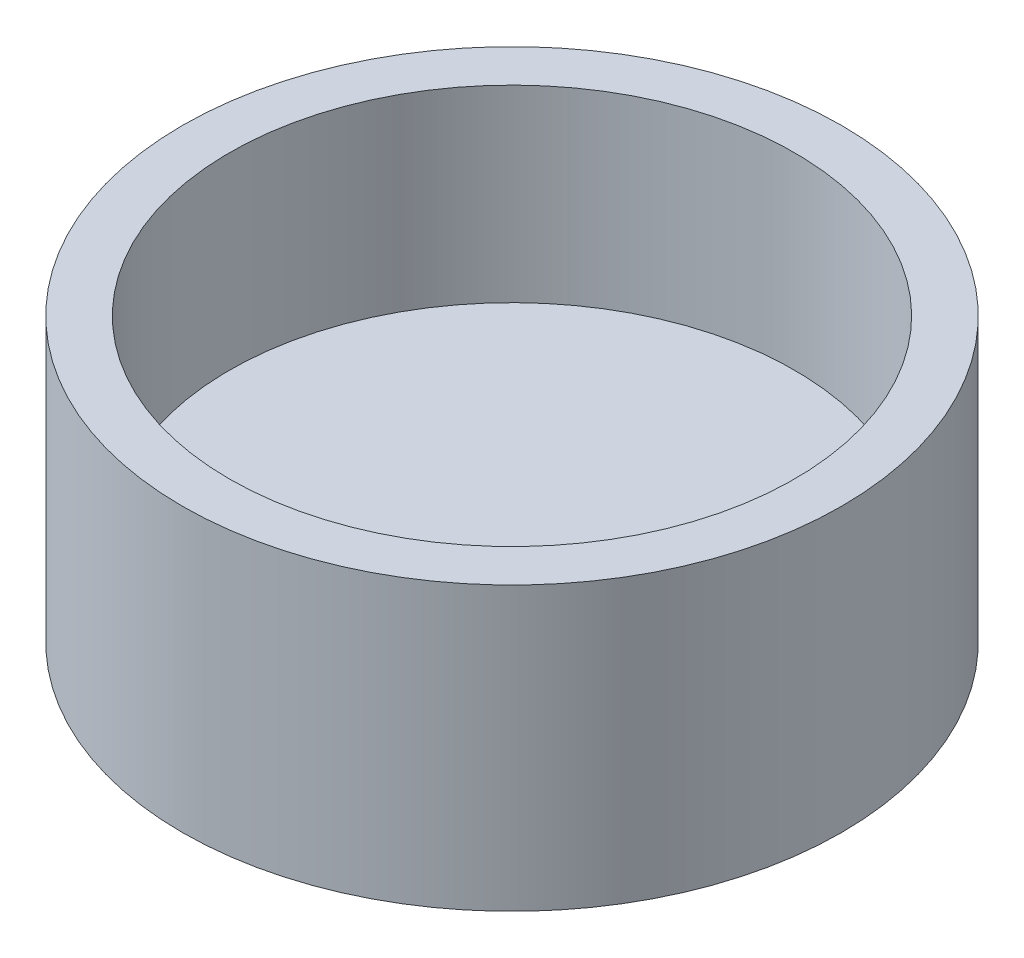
ISO-10303-21;
HEADER;
FILE_DESCRIPTION(('STEP AP214'),'2;1');
FILE_NAME('part.step','',(''),(''),'','','');
FILE_SCHEMA(('AUTOMOTIVE_DESIGN { 1 0 10303 214 1 1 1 1 }'));
ENDSEC;
DATA;
#1=APPLICATION_CONTEXT('core data for automotive mechanical design processes');
#2=APPLICATION_PROTOCOL_DEFINITION('international standard','automotive_design',2000,#1);
#3=PRODUCT_CONTEXT('',#1,'mechanical');
#4=PRODUCT('Part','Part','',(#3));
#5=PRODUCT_RELATED_PRODUCT_CATEGORY('part','',(#4));
#6=PRODUCT_DEFINITION_FORMATION('','',#4);
#7=PRODUCT_DEFINITION_CONTEXT('part definition',#1,'design');
#8=PRODUCT_DEFINITION('design','',#6,#7);
#9=PRODUCT_DEFINITION_SHAPE('','',#8);
#10=(LENGTH_UNIT() NAMED_UNIT(*) SI_UNIT(.MILLI.,.METRE.));
#11=(NAMED_UNIT(*) PLANE_ANGLE_UNIT() SI_UNIT($,.RADIAN.));
#12=(NAMED_UNIT(*) SI_UNIT($,.STERADIAN.) SOLID_ANGLE_UNIT());
#13=UNCERTAINTY_MEASURE_WITH_UNIT(LENGTH_MEASURE(1.E-05),#10,'distance_accuracy_value','');
#14=(GEOMETRIC_REPRESENTATION_CONTEXT(3) GLOBAL_UNCERTAINTY_ASSIGNED_CONTEXT((#13)) GLOBAL_UNIT_ASSIGNED_CONTEXT((#10,
#11,#12)) REPRESENTATION_CONTEXT('',''));
#15=CARTESIAN_POINT('',(0.,0.,0.));
#16=DIRECTION('',(0.,0.,1.));
#17=DIRECTION('',(1.,0.,0.));
#18=AXIS2_PLACEMENT_3D('',#15,#16,#17);
#19=CARTESIAN_POINT('',(0.,38.1,0.));
#20=DIRECTION('',(0.,-1.,0.));
#21=DIRECTION('',(0.,0.,-1.));
#22=AXIS2_PLACEMENT_3D('',#19,#20,#21);
#23=CYLINDRICAL_SURFACE('',#22,44.45);
#24=CARTESIAN_POINT('',(0.,38.1,0.));
#25=DIRECTION('',(0.,1.,0.));
#26=DIRECTION('',(0.,0.,1.));
#27=AXIS2_PLACEMENT_3D('',#24,#25,#26);
#28=CIRCLE('',#27,44.45);
#29=CARTESIAN_POINT('',(0.,38.1,-44.45));
#30=VERTEX_POINT('',#29);
#31=EDGE_CURVE('E10',#30,#30,#28,.T.);
#32=CARTESIAN_POINT('',(0.,0.,0.));
#33=DIRECTION('',(0.,1.,0.));
#34=DIRECTION('',(0.,0.,1.));
#35=AXIS2_PLACEMENT_3D('',#32,#33,#34);
#36=CIRCLE('',#35,44.45);
#37=CARTESIAN_POINT('',(0.,0.,-44.45));
#38=VERTEX_POINT('',#37);
#39=EDGE_CURVE('E42',#38,#38,#36,.T.);
#40=CARTESIAN_POINT('',(0.,38.1,-44.45));
#41=CARTESIAN_POINT('',(0.,37.703125,-44.45));
#42=CARTESIAN_POINT('',(0.,37.30625,-44.45));
#43=CARTESIAN_POINT('',(0.,36.5125,-44.45));
#44=CARTESIAN_POINT('',(0.,36.115625,-44.45));
#45=CARTESIAN_POINT('',(0.,35.321875,-44.45));
#46=CARTESIAN_POINT('',(0.,34.925,-44.45));
#47=CARTESIAN_POINT('',(0.,34.13125,-44.45));
#48=CARTESIAN_POINT('',(0.,33.734375,-44.45));
#49=CARTESIAN_POINT('',(0.,32.940625,-44.45));
#50=CARTESIAN_POINT('',(0.,32.54375,-44.45));
#51=CARTESIAN_POINT('',(0.,31.75,-44.45));
#52=CARTESIAN_POINT('',(0.,31.353125,-44.45));
#53=CARTESIAN_POINT('',(0.,30.559375,-44.45));
#54=CARTESIAN_POINT('',(0.,30.1625,-44.45));
#55=CARTESIAN_POINT('',(0.,29.36875,-44.45));
#56=CARTESIAN_POINT('',(0.,28.971875,-44.45));
#57=CARTESIAN_POINT('',(0.,28.178125,-44.45));
#58=CARTESIAN_POINT('',(0.,27.78125,-44.45));
#59=CARTESIAN_POINT('',(0.,26.9875,-44.45));
#60=CARTESIAN_POINT('',(0.,26.590625,-44.45));
#61=CARTESIAN_POINT('',(0.,25.796875,-44.45));
#62=CARTESIAN_POINT('',(0.,25.4,-44.45));
#63=CARTESIAN_POINT('',(0.,24.60625,-44.45));
#64=CARTESIAN_POINT('',(0.,24.209375,-44.45));
#65=CARTESIAN_POINT('',(0.,23.415625,-44.45));
#66=CARTESIAN_POINT('',(0.,23.01875,-44.45));
#67=CARTESIAN_POINT('',(0.,22.225,-44.45));
#68=CARTESIAN_POINT('',(0.,21.828125,-44.45));
#69=CARTESIAN_POINT('',(0.,21.034375,-44.45));
#70=CARTESIAN_POINT('',(0.,20.6375,-44.45));
#71=CARTESIAN_POINT('',(0.,19.84375,-44.45));
#72=CARTESIAN_POINT('',(0.,19.446875,-44.45));
#73=CARTESIAN_POINT('',(0.,18.653125,-44.45));
#74=CARTESIAN_POINT('',(0.,18.25625,-44.45));
#75=CARTESIAN_POINT('',(0.,17.4625,-44.45));
#76=CARTESIAN_POINT('',(0.,17.065625,-44.45));
#77=CARTESIAN_POINT('',(0.,16.271875,-44.45));
#78=CARTESIAN_POINT('',(0.,15.875,-44.45));
#79=CARTESIAN_POINT('',(0.,15.08125,-44.45));
#80=CARTESIAN_POINT('',(0.,14.684375,-44.45));
#81=CARTESIAN_POINT('',(0.,13.890625,-44.45));
#82=CARTESIAN_POINT('',(0.,13.49375,-44.45));
#83=CARTESIAN_POINT('',(0.,12.7,-44.45));
#84=CARTESIAN_POINT('',(0.,12.303125,-44.45));
#85=CARTESIAN_POINT('',(0.,11.509375,-44.45));
#86=CARTESIAN_POINT('',(0.,11.1125,-44.45));
#87=CARTESIAN_POINT('',(0.,10.31875,-44.45));
#88=CARTESIAN_POINT('',(0.,9.921875,-44.45));
#89=CARTESIAN_POINT('',(0.,9.128125,-44.45));
#90=CARTESIAN_POINT('',(0.,8.73125,-44.45));
#91=CARTESIAN_POINT('',(0.,7.9375,-44.45));
#92=CARTESIAN_POINT('',(0.,7.540625,-44.45));
#93=CARTESIAN_POINT('',(0.,6.746875,-44.45));
#94=CARTESIAN_POINT('',(0.,6.35,-44.45));
#95=CARTESIAN_POINT('',(0.,5.55625,-44.45));
#96=CARTESIAN_POINT('',(0.,5.159375,-44.45));
#97=CARTESIAN_POINT('',(0.,4.365625,-44.45));
#98=CARTESIAN_POINT('',(0.,3.96875,-44.45));
#99=CARTESIAN_POINT('',(0.,3.175,-44.45));
#100=CARTESIAN_POINT('',(0.,2.778125,-44.45));
#101=CARTESIAN_POINT('',(0.,1.984375,-44.45));
#102=CARTESIAN_POINT('',(0.,1.5875,-44.45));
#103=CARTESIAN_POINT('',(0.,0.79375,-44.45));
#104=CARTESIAN_POINT('',(0.,0.396875,-44.45));
#105=CARTESIAN_POINT('',(0.,0.,-44.45));
#106=B_SPLINE_CURVE_WITH_KNOTS('',3,(#40,#41,#42,#43,#44,#45,#46,#47,#48,#49,#50,#51,#52,#53,
#54,#55,#56,#57,#58,#59,#60,#61,#62,#63,#64,#65,#66,#67,#68,#69,#70,#71,#72,#73,#74,#75,#76,#77,
#78,#79,#80,#81,#82,#83,#84,#85,#86,#87,#88,#89,#90,#91,#92,#93,#94,#95,#96,#97,#98,#99,#100,
#101,#102,#103,#104,#105),.UNSPECIFIED.,.F.,.F.,(4,2,2,2,2,2,2,2,2,2,2,2,2,2,2,2,2,2,2,2,2,2,2,
2,2,2,2,2,2,2,2,2,4),(0.,1.19062499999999,2.38124999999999,3.571875,4.7625,5.953125,7.14375,
8.33437499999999,9.525,10.715625,11.90625,13.096875,14.2875,15.478125,16.66875,17.859375,19.05,
20.240625,21.43125,22.621875,23.8125,25.003125,26.19375,27.384375,28.575,29.765625,30.95625,
32.146875,33.3375,34.528125,35.71875,36.909375,38.1),.UNSPECIFIED.);
#107=EDGE_CURVE('BSEAM39',#30,#38,#106,.T.);
#108=ORIENTED_EDGE('',*,*,#31,.F.);
#109=ORIENTED_EDGE('',*,*,#39,.T.);
#110=ORIENTED_EDGE('',*,*,#107,.T.);
#111=ORIENTED_EDGE('',*,*,#107,.F.);
#112=EDGE_LOOP('',(#108,#110,#109,#111));
#113=FACE_BOUND('',#112,.T.);
#114=ADVANCED_FACE('F39',(#113),#23,.T.);
#115=CARTESIAN_POINT('',(0.,38.1,0.));
#116=DIRECTION('',(0.,1.,0.));
#117=DIRECTION('',(0.,0.,1.));
#118=AXIS2_PLACEMENT_3D('',#115,#116,#117);
#119=PLANE('',#118);
#120=CARTESIAN_POINT('',(0.,38.1,0.));
#121=DIRECTION('',(0.,1.,0.));
#122=DIRECTION('',(0.,0.,1.));
#123=AXIS2_PLACEMENT_3D('',#120,#121,#122);
#124=CIRCLE('',#123,38.1);
#125=CARTESIAN_POINT('',(0.,38.1,38.1));
#126=VERTEX_POINT('',#125);
#127=EDGE_CURVE('E51',#126,#126,#124,.T.);
#128=ORIENTED_EDGE('',*,*,#127,.F.);
#129=EDGE_LOOP('',(#128));
#130=FACE_BOUND('',#129,.T.);
#131=ORIENTED_EDGE('',*,*,#31,.T.);
#132=EDGE_LOOP('',(#131));
#133=FACE_BOUND('',#132,.T.);
#134=ADVANCED_FACE('F66',(#130,#133),#119,.T.);
#135=CARTESIAN_POINT('',(0.,0.,0.));
#136=DIRECTION('',(0.,1.,0.));
#137=DIRECTION('',(0.,0.,1.));
#138=AXIS2_PLACEMENT_3D('',#135,#136,#137);
#139=PLANE('',#138);
#140=ORIENTED_EDGE('',*,*,#39,.F.);
#141=EDGE_LOOP('',(#140));
#142=FACE_BOUND('',#141,.T.);
#143=ADVANCED_FACE('F62',(#142),#139,.F.);
#144=CARTESIAN_POINT('',(0.,12.7,0.));
#145=DIRECTION('',(0.,1.,0.));
#146=DIRECTION('',(0.,0.,1.));
#147=AXIS2_PLACEMENT_3D('',#144,#145,#146);
#148=CYLINDRICAL_SURFACE('',#147,38.1);
#149=CARTESIAN_POINT('',(0.,12.7,0.));
#150=DIRECTION('',(0.,1.,0.));
#151=DIRECTION('',(0.,0.,1.));
#152=AXIS2_PLACEMENT_3D('',#149,#150,#151);
#153=CIRCLE('',#152,38.1);
#154=CARTESIAN_POINT('',(0.,12.7,38.1));
#155=VERTEX_POINT('',#154);
#156=EDGE_CURVE('E49',#155,#155,#153,.T.);
#157=ORIENTED_EDGE('',*,*,#156,.F.);
#158=EDGE_LOOP('',(#157));
#159=FACE_BOUND('',#158,.T.);
#160=ORIENTED_EDGE('',*,*,#127,.T.);
#161=EDGE_LOOP('',(#160));
#162=FACE_BOUND('',#161,.T.);
#163=ADVANCED_FACE('F59',(#159,#162),#148,.F.);
#164=CARTESIAN_POINT('',(0.,12.7,0.));
#165=DIRECTION('',(0.,1.,0.));
#166=DIRECTION('',(0.,0.,1.));
#167=AXIS2_PLACEMENT_3D('',#164,#165,#166);
#168=PLANE('',#167);
#169=ORIENTED_EDGE('',*,*,#156,.T.);
#170=EDGE_LOOP('',(#169));
#171=FACE_BOUND('',#170,.T.);
#172=ADVANCED_FACE('F57',(#171),#168,.T.);
#173=CLOSED_SHELL('',(#114,#134,#143,#163,#172));
#174=MANIFOLD_SOLID_BREP('B2',#173);
#175=ADVANCED_BREP_SHAPE_REPRESENTATION('',(#18,#174),#14);
#176=SHAPE_DEFINITION_REPRESENTATION(#9,#175);
ENDSEC;
END-ISO-10303-21;
